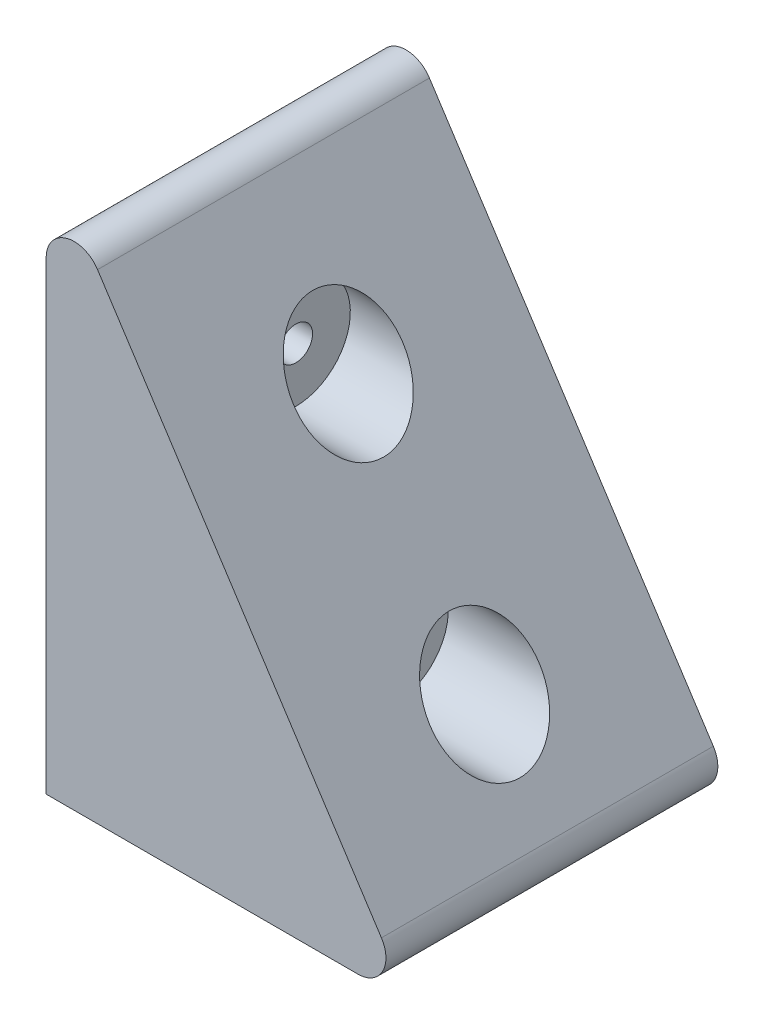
ISO-10303-21;
HEADER;
FILE_DESCRIPTION(('STEP AP214'),'2;1');
FILE_NAME('part.step','',(''),(''),'','','');
FILE_SCHEMA(('AUTOMOTIVE_DESIGN { 1 0 10303 214 1 1 1 1 }'));
ENDSEC;
DATA;
#1=APPLICATION_CONTEXT('core data for automotive mechanical design processes');
#2=APPLICATION_PROTOCOL_DEFINITION('international standard','automotive_design',2000,#1);
#3=PRODUCT_CONTEXT('',#1,'mechanical');
#4=PRODUCT('Part','Part','',(#3));
#5=PRODUCT_RELATED_PRODUCT_CATEGORY('part','',(#4));
#6=PRODUCT_DEFINITION_FORMATION('','',#4);
#7=PRODUCT_DEFINITION_CONTEXT('part definition',#1,'design');
#8=PRODUCT_DEFINITION('design','',#6,#7);
#9=PRODUCT_DEFINITION_SHAPE('','',#8);
#10=(LENGTH_UNIT() NAMED_UNIT(*) SI_UNIT(.MILLI.,.METRE.));
#11=(NAMED_UNIT(*) PLANE_ANGLE_UNIT() SI_UNIT($,.RADIAN.));
#12=(NAMED_UNIT(*) SI_UNIT($,.STERADIAN.) SOLID_ANGLE_UNIT());
#13=UNCERTAINTY_MEASURE_WITH_UNIT(LENGTH_MEASURE(1.E-05),#10,'distance_accuracy_value','');
#14=(GEOMETRIC_REPRESENTATION_CONTEXT(3) GLOBAL_UNCERTAINTY_ASSIGNED_CONTEXT((#13)) GLOBAL_UNIT_ASSIGNED_CONTEXT((#10,
#11,#12)) REPRESENTATION_CONTEXT('',''));
#15=CARTESIAN_POINT('',(0.,0.,0.));
#16=DIRECTION('',(0.,0.,1.));
#17=DIRECTION('',(1.,0.,0.));
#18=AXIS2_PLACEMENT_3D('',#15,#16,#17);
#19=CARTESIAN_POINT('',(0.,0.,30.1625));
#20=DIRECTION('',(1.,0.,0.));
#21=DIRECTION('',(0.,0.,-1.));
#22=AXIS2_PLACEMENT_3D('',#19,#20,#21);
#23=PLANE('',#22);
#24=CARTESIAN_POINT('',(0.,31.75,15.0932352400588));
#25=DIRECTION('',(1.,0.,0.));
#26=DIRECTION('',(0.,0.,-1.));
#27=AXIS2_PLACEMENT_3D('',#24,#25,#26);
#28=CIRCLE('',#27,1.524);
#29=CARTESIAN_POINT('',(0.,31.75,13.5692352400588));
#30=VERTEX_POINT('',#29);
#31=EDGE_CURVE('E38',#30,#30,#28,.T.);
#32=ORIENTED_EDGE('',*,*,#31,.T.);
#33=EDGE_LOOP('',(#32));
#34=FACE_BOUND('',#33,.T.);
#35=CARTESIAN_POINT('',(0.,12.7,15.08125));
#36=DIRECTION('',(1.,0.,0.));
#37=DIRECTION('',(0.,0.,-1.));
#38=AXIS2_PLACEMENT_3D('',#35,#36,#37);
#39=CIRCLE('',#38,1.524);
#40=CARTESIAN_POINT('',(0.,12.7,13.55725));
#41=VERTEX_POINT('',#40);
#42=EDGE_CURVE('E127',#41,#41,#39,.T.);
#43=ORIENTED_EDGE('',*,*,#42,.T.);
#44=EDGE_LOOP('',(#43));
#45=FACE_BOUND('',#44,.T.);
#46=DIRECTION('',(0.,-1.,0.));
#47=VECTOR('',#46,1.);
#48=CARTESIAN_POINT('',(0.,0.,0.));
#49=LINE('',#48,#47);
#50=CARTESIAN_POINT('',(0.,42.2316576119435,0.));
#51=VERTEX_POINT('',#50);
#52=CARTESIAN_POINT('',(0.,0.,0.));
#53=VERTEX_POINT('',#52);
#54=EDGE_CURVE('E111',#51,#53,#49,.T.);
#55=ORIENTED_EDGE('',*,*,#54,.T.);
#56=DIRECTION('',(0.,0.,-1.));
#57=VECTOR('',#56,1.);
#58=CARTESIAN_POINT('',(0.,0.,30.1625));
#59=LINE('',#58,#57);
#60=CARTESIAN_POINT('',(0.,0.,30.1625));
#61=VERTEX_POINT('',#60);
#62=EDGE_CURVE('E11',#61,#53,#59,.T.);
#63=ORIENTED_EDGE('',*,*,#62,.F.);
#64=DIRECTION('',(0.,-1.,0.));
#65=VECTOR('',#64,1.);
#66=CARTESIAN_POINT('',(0.,0.,30.1625));
#67=LINE('',#66,#65);
#68=CARTESIAN_POINT('',(0.,42.2316576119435,30.1625));
#69=VERTEX_POINT('',#68);
#70=EDGE_CURVE('E120',#69,#61,#67,.T.);
#71=ORIENTED_EDGE('',*,*,#70,.F.);
#72=DIRECTION('',(0.,0.,-1.));
#73=VECTOR('',#72,1.);
#74=CARTESIAN_POINT('',(0.,42.2316576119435,30.1625));
#75=LINE('',#74,#73);
#76=EDGE_CURVE('E107',#69,#51,#75,.T.);
#77=ORIENTED_EDGE('',*,*,#76,.T.);
#78=EDGE_LOOP('',(#55,#63,#71,#77));
#79=FACE_BOUND('',#78,.T.);
#80=ADVANCED_FACE('F35',(#34,#45,#79),#23,.F.);
#81=CARTESIAN_POINT('',(0.,0.,30.1625));
#82=DIRECTION('',(0.,1.,0.));
#83=DIRECTION('',(0.,0.,1.));
#84=AXIS2_PLACEMENT_3D('',#81,#82,#83);
#85=PLANE('',#84);
#86=DIRECTION('',(1.,0.,0.));
#87=VECTOR('',#86,1.);
#88=CARTESIAN_POINT('',(0.,0.,0.));
#89=LINE('',#88,#87);
#90=CARTESIAN_POINT('',(28.3395774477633,0.,0.));
#91=VERTEX_POINT('',#90);
#92=EDGE_CURVE('E114',#53,#91,#89,.T.);
#93=ORIENTED_EDGE('',*,*,#92,.T.);
#94=DIRECTION('',(0.,0.,-1.));
#95=VECTOR('',#94,1.);
#96=CARTESIAN_POINT('',(28.3395774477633,0.,30.1625));
#97=LINE('',#96,#95);
#98=CARTESIAN_POINT('',(28.3395774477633,0.,30.1625));
#99=VERTEX_POINT('',#98);
#100=EDGE_CURVE('E44',#99,#91,#97,.T.);
#101=ORIENTED_EDGE('',*,*,#100,.F.);
#102=DIRECTION('',(1.,0.,0.));
#103=VECTOR('',#102,1.);
#104=CARTESIAN_POINT('',(0.,0.,30.1625));
#105=LINE('',#104,#103);
#106=EDGE_CURVE('E87',#61,#99,#105,.T.);
#107=ORIENTED_EDGE('',*,*,#106,.F.);
#108=ORIENTED_EDGE('',*,*,#62,.T.);
#109=EDGE_LOOP('',(#93,#101,#107,#108));
#110=FACE_BOUND('',#109,.T.);
#111=ADVANCED_FACE('F151',(#110),#85,.F.);
#112=CARTESIAN_POINT('',(28.3395774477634,2.54,30.1625));
#113=DIRECTION('',(0.,0.,-1.));
#114=DIRECTION('',(-1.,0.,0.));
#115=AXIS2_PLACEMENT_3D('',#112,#113,#114);
#116=CYLINDRICAL_SURFACE('',#115,2.54);
#117=CARTESIAN_POINT('',(28.3395774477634,2.54,0.));
#118=DIRECTION('',(0.,0.,1.));
#119=DIRECTION('',(1.,0.,0.));
#120=AXIS2_PLACEMENT_3D('',#117,#118,#119);
#121=CIRCLE('',#120,2.54);
#122=CARTESIAN_POINT('',(30.469224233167,3.92427041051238,0.));
#123=VERTEX_POINT('',#122);
#124=EDGE_CURVE('E102',#91,#123,#121,.T.);
#125=ORIENTED_EDGE('',*,*,#124,.T.);
#126=DIRECTION('',(0.,0.,-1.));
#127=VECTOR('',#126,1.);
#128=CARTESIAN_POINT('',(30.469224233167,3.92427041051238,30.1625));
#129=LINE('',#128,#127);
#130=CARTESIAN_POINT('',(30.469224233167,3.92427041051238,30.1625));
#131=VERTEX_POINT('',#130);
#132=EDGE_CURVE('E99',#131,#123,#129,.T.);
#133=ORIENTED_EDGE('',*,*,#132,.F.);
#134=CARTESIAN_POINT('',(28.3395774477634,2.54,30.1625));
#135=DIRECTION('',(0.,0.,1.));
#136=DIRECTION('',(1.,0.,0.));
#137=AXIS2_PLACEMENT_3D('',#134,#135,#136);
#138=CIRCLE('',#137,2.54);
#139=EDGE_CURVE('E91',#99,#131,#138,.T.);
#140=ORIENTED_EDGE('',*,*,#139,.F.);
#141=ORIENTED_EDGE('',*,*,#100,.T.);
#142=EDGE_LOOP('',(#125,#133,#140,#141));
#143=FACE_BOUND('',#142,.T.);
#144=ADVANCED_FACE('F100',(#143),#116,.T.);
#145=CARTESIAN_POINT('',(4.66964678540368,43.6159280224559,30.1625));
#146=DIRECTION('',(-0.838443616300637,-0.544988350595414,0.));
#147=DIRECTION('',(0.544988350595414,-0.838443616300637,0.));
#148=AXIS2_PLACEMENT_3D('',#145,#146,#147);
#149=PLANE('',#148);
#150=CARTESIAN_POINT('',(12.3825,31.75,15.0932352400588));
#151=DIRECTION('',(-0.838443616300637,-0.544988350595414,0.));
#152=DIRECTION('',(0.544988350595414,-0.838443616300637,0.));
#153=AXIS2_PLACEMENT_3D('',#150,#151,#152);
#154=ELLIPSE('',#153,5.90737397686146,4.953);
#155=CARTESIAN_POINT('',(15.60195,26.797,15.0932352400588));
#156=VERTEX_POINT('',#155);
#157=EDGE_CURVE('E130',#156,#156,#154,.F.);
#158=ORIENTED_EDGE('',*,*,#157,.F.);
#159=EDGE_LOOP('',(#158));
#160=FACE_BOUND('',#159,.T.);
#161=CARTESIAN_POINT('',(24.765,12.7,15.08125));
#162=DIRECTION('',(-0.838443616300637,-0.544988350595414,0.));
#163=DIRECTION('',(0.544988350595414,-0.838443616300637,0.));
#164=AXIS2_PLACEMENT_3D('',#161,#162,#163);
#165=ELLIPSE('',#164,5.90737397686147,4.953);
#166=CARTESIAN_POINT('',(27.98445,7.747,15.08125));
#167=VERTEX_POINT('',#166);
#168=EDGE_CURVE('E115',#167,#167,#165,.F.);
#169=ORIENTED_EDGE('',*,*,#168,.F.);
#170=EDGE_LOOP('',(#169));
#171=FACE_BOUND('',#170,.T.);
#172=DIRECTION('',(-0.544988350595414,0.838443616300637,0.));
#173=VECTOR('',#172,1.);
#174=CARTESIAN_POINT('',(4.66964678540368,43.6159280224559,0.));
#175=LINE('',#174,#173);
#176=CARTESIAN_POINT('',(4.66964678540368,43.6159280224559,0.));
#177=VERTEX_POINT('',#176);
#178=EDGE_CURVE('E73',#123,#177,#175,.T.);
#179=ORIENTED_EDGE('',*,*,#178,.T.);
#180=DIRECTION('',(0.,0.,-1.));
#181=VECTOR('',#180,1.);
#182=CARTESIAN_POINT('',(4.66964678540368,43.6159280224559,30.1625));
#183=LINE('',#182,#181);
#184=CARTESIAN_POINT('',(4.66964678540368,43.6159280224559,30.1625));
#185=VERTEX_POINT('',#184);
#186=EDGE_CURVE('E103',#185,#177,#183,.T.);
#187=ORIENTED_EDGE('',*,*,#186,.F.);
#188=DIRECTION('',(-0.544988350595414,0.838443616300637,0.));
#189=VECTOR('',#188,1.);
#190=CARTESIAN_POINT('',(4.66964678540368,43.6159280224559,30.1625));
#191=LINE('',#190,#189);
#192=EDGE_CURVE('E95',#131,#185,#191,.T.);
#193=ORIENTED_EDGE('',*,*,#192,.F.);
#194=ORIENTED_EDGE('',*,*,#132,.T.);
#195=EDGE_LOOP('',(#179,#187,#193,#194));
#196=FACE_BOUND('',#195,.T.);
#197=ADVANCED_FACE('F105',(#160,#171,#196),#149,.F.);
#198=CARTESIAN_POINT('',(2.54,42.2316576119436,30.1625));
#199=DIRECTION('',(0.,0.,-1.));
#200=DIRECTION('',(-1.,0.,0.));
#201=AXIS2_PLACEMENT_3D('',#198,#199,#200);
#202=CYLINDRICAL_SURFACE('',#201,2.54);
#203=CARTESIAN_POINT('',(2.54,42.2316576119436,0.));
#204=DIRECTION('',(0.,0.,1.));
#205=DIRECTION('',(-1.,0.,0.));
#206=AXIS2_PLACEMENT_3D('',#203,#204,#205);
#207=CIRCLE('',#206,2.54);
#208=EDGE_CURVE('E79',#177,#51,#207,.T.);
#209=ORIENTED_EDGE('',*,*,#208,.T.);
#210=ORIENTED_EDGE('',*,*,#76,.F.);
#211=CARTESIAN_POINT('',(2.54,42.2316576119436,30.1625));
#212=DIRECTION('',(0.,0.,1.));
#213=DIRECTION('',(-1.,0.,0.));
#214=AXIS2_PLACEMENT_3D('',#211,#212,#213);
#215=CIRCLE('',#214,2.54);
#216=EDGE_CURVE('E53',#185,#69,#215,.T.);
#217=ORIENTED_EDGE('',*,*,#216,.F.);
#218=ORIENTED_EDGE('',*,*,#186,.T.);
#219=EDGE_LOOP('',(#209,#210,#217,#218));
#220=FACE_BOUND('',#219,.T.);
#221=ADVANCED_FACE('F164',(#220),#202,.T.);
#222=CARTESIAN_POINT('',(2.54,42.2316576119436,30.1625));
#223=DIRECTION('',(0.,0.,-1.));
#224=DIRECTION('',(-1.,0.,0.));
#225=AXIS2_PLACEMENT_3D('',#222,#223,#224);
#226=PLANE('',#225);
#227=ORIENTED_EDGE('',*,*,#70,.T.);
#228=ORIENTED_EDGE('',*,*,#106,.T.);
#229=ORIENTED_EDGE('',*,*,#139,.T.);
#230=ORIENTED_EDGE('',*,*,#192,.T.);
#231=ORIENTED_EDGE('',*,*,#216,.T.);
#232=EDGE_LOOP('',(#227,#228,#229,#230,#231));
#233=FACE_BOUND('',#232,.T.);
#234=ADVANCED_FACE('F93',(#233),#226,.F.);
#235=CARTESIAN_POINT('',(2.54,42.2316576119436,0.));
#236=DIRECTION('',(0.,0.,-1.));
#237=DIRECTION('',(-1.,0.,0.));
#238=AXIS2_PLACEMENT_3D('',#235,#236,#237);
#239=PLANE('',#238);
#240=ORIENTED_EDGE('',*,*,#54,.F.);
#241=ORIENTED_EDGE('',*,*,#208,.F.);
#242=ORIENTED_EDGE('',*,*,#178,.F.);
#243=ORIENTED_EDGE('',*,*,#124,.F.);
#244=ORIENTED_EDGE('',*,*,#92,.F.);
#245=EDGE_LOOP('',(#240,#241,#242,#243,#244));
#246=FACE_BOUND('',#245,.T.);
#247=ADVANCED_FACE('F153',(#246),#239,.T.);
#248=CARTESIAN_POINT('',(16.51,12.7,15.08125));
#249=DIRECTION('',(1.,0.,0.));
#250=DIRECTION('',(0.,0.,-1.));
#251=AXIS2_PLACEMENT_3D('',#248,#249,#250);
#252=CYLINDRICAL_SURFACE('',#251,4.953);
#253=CARTESIAN_POINT('',(16.51,12.7,15.08125));
#254=DIRECTION('',(-1.,0.,0.));
#255=DIRECTION('',(0.,0.,1.));
#256=AXIS2_PLACEMENT_3D('',#253,#254,#255);
#257=CIRCLE('',#256,4.953);
#258=CARTESIAN_POINT('',(16.51,12.7,20.03425));
#259=VERTEX_POINT('',#258);
#260=EDGE_CURVE('E126',#259,#259,#257,.T.);
#261=ORIENTED_EDGE('',*,*,#260,.T.);
#262=EDGE_LOOP('',(#261));
#263=FACE_BOUND('',#262,.T.);
#264=ORIENTED_EDGE('',*,*,#168,.T.);
#265=EDGE_LOOP('',(#264));
#266=FACE_BOUND('',#265,.T.);
#267=ADVANCED_FACE('F155',(#263,#266),#252,.F.);
#268=CARTESIAN_POINT('',(16.51,12.7,15.08125));
#269=DIRECTION('',(-1.,0.,0.));
#270=DIRECTION('',(0.,0.,1.));
#271=AXIS2_PLACEMENT_3D('',#268,#269,#270);
#272=PLANE('',#271);
#273=CARTESIAN_POINT('',(16.51,12.7,15.08125));
#274=DIRECTION('',(1.,0.,0.));
#275=DIRECTION('',(0.,0.,-1.));
#276=AXIS2_PLACEMENT_3D('',#273,#274,#275);
#277=CIRCLE('',#276,1.524);
#278=CARTESIAN_POINT('',(16.51,12.7,13.55725));
#279=VERTEX_POINT('',#278);
#280=EDGE_CURVE('E129',#279,#279,#277,.T.);
#281=ORIENTED_EDGE('',*,*,#280,.F.);
#282=EDGE_LOOP('',(#281));
#283=FACE_BOUND('',#282,.T.);
#284=ORIENTED_EDGE('',*,*,#260,.F.);
#285=EDGE_LOOP('',(#284));
#286=FACE_BOUND('',#285,.T.);
#287=ADVANCED_FACE('F161',(#283,#286),#272,.F.);
#288=CARTESIAN_POINT('',(-8.89,12.7,15.08125));
#289=DIRECTION('',(1.,0.,0.));
#290=DIRECTION('',(0.,0.,-1.));
#291=AXIS2_PLACEMENT_3D('',#288,#289,#290);
#292=CYLINDRICAL_SURFACE('',#291,1.524);
#293=ORIENTED_EDGE('',*,*,#280,.T.);
#294=EDGE_LOOP('',(#293));
#295=FACE_BOUND('',#294,.T.);
#296=ORIENTED_EDGE('',*,*,#42,.F.);
#297=EDGE_LOOP('',(#296));
#298=FACE_BOUND('',#297,.T.);
#299=ADVANCED_FACE('F176',(#295,#298),#292,.F.);
#300=CARTESIAN_POINT('',(7.62,31.75,15.0932352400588));
#301=DIRECTION('',(1.,0.,0.));
#302=DIRECTION('',(0.,0.,-1.));
#303=AXIS2_PLACEMENT_3D('',#300,#301,#302);
#304=CYLINDRICAL_SURFACE('',#303,4.953);
#305=CARTESIAN_POINT('',(7.62,31.75,15.0932352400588));
#306=DIRECTION('',(-1.,0.,0.));
#307=DIRECTION('',(0.,0.,1.));
#308=AXIS2_PLACEMENT_3D('',#305,#306,#307);
#309=CIRCLE('',#308,4.953);
#310=CARTESIAN_POINT('',(7.62,31.75,20.0462352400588));
#311=VERTEX_POINT('',#310);
#312=EDGE_CURVE('E132',#311,#311,#309,.T.);
#313=ORIENTED_EDGE('',*,*,#312,.T.);
#314=EDGE_LOOP('',(#313));
#315=FACE_BOUND('',#314,.T.);
#316=ORIENTED_EDGE('',*,*,#157,.T.);
#317=EDGE_LOOP('',(#316));
#318=FACE_BOUND('',#317,.T.);
#319=ADVANCED_FACE('F178',(#315,#318),#304,.F.);
#320=CARTESIAN_POINT('',(7.62,31.75,15.0932352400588));
#321=DIRECTION('',(-1.,0.,0.));
#322=DIRECTION('',(0.,0.,1.));
#323=AXIS2_PLACEMENT_3D('',#320,#321,#322);
#324=PLANE('',#323);
#325=CARTESIAN_POINT('',(7.62,31.75,15.0932352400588));
#326=DIRECTION('',(1.,0.,0.));
#327=DIRECTION('',(0.,0.,-1.));
#328=AXIS2_PLACEMENT_3D('',#325,#326,#327);
#329=CIRCLE('',#328,1.524);
#330=CARTESIAN_POINT('',(7.62,31.75,13.5692352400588));
#331=VERTEX_POINT('',#330);
#332=EDGE_CURVE('E142',#331,#331,#329,.T.);
#333=ORIENTED_EDGE('',*,*,#332,.F.);
#334=EDGE_LOOP('',(#333));
#335=FACE_BOUND('',#334,.T.);
#336=ORIENTED_EDGE('',*,*,#312,.F.);
#337=EDGE_LOOP('',(#336));
#338=FACE_BOUND('',#337,.T.);
#339=ADVANCED_FACE('F185',(#335,#338),#324,.F.);
#340=CARTESIAN_POINT('',(-5.08,31.75,15.0932352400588));
#341=DIRECTION('',(1.,0.,0.));
#342=DIRECTION('',(0.,0.,-1.));
#343=AXIS2_PLACEMENT_3D('',#340,#341,#342);
#344=CYLINDRICAL_SURFACE('',#343,1.524);
#345=ORIENTED_EDGE('',*,*,#332,.T.);
#346=EDGE_LOOP('',(#345));
#347=FACE_BOUND('',#346,.T.);
#348=ORIENTED_EDGE('',*,*,#31,.F.);
#349=EDGE_LOOP('',(#348));
#350=FACE_BOUND('',#349,.T.);
#351=ADVANCED_FACE('F192',(#347,#350),#344,.F.);
#352=CLOSED_SHELL('',(#80,#111,#144,#197,#221,#234,#247,#267,#287,#299,#319,#339,#351));
#353=MANIFOLD_SOLID_BREP('B2',#352);
#354=ADVANCED_BREP_SHAPE_REPRESENTATION('',(#18,#353),#14);
#355=SHAPE_DEFINITION_REPRESENTATION(#9,#354);
ENDSEC;
END-ISO-10303-21;
